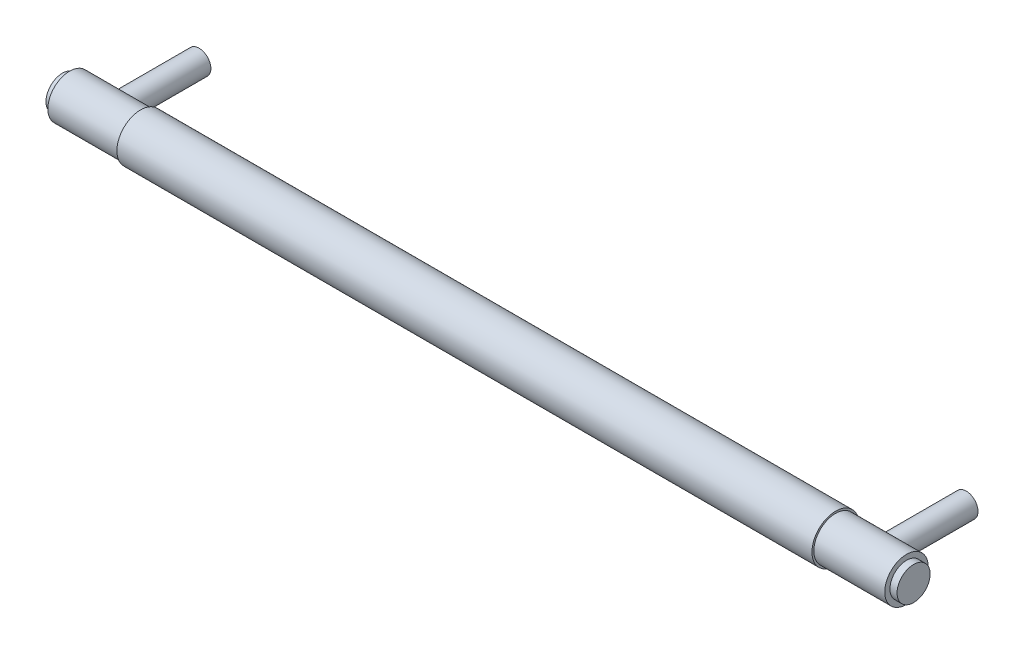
from build123d import *

# Parameters (mm, degrees)
SKETCH1_R           = 10
BOSS_EXTRUDE1_DEPTH = 147
SKETCH2_R           = 9.2
BOSS_EXTRUDE3_DEPTH = 30
SKETCH3_R           = 7
BOSS_EXTRUDE4_DEPTH = 3
SKETCH4_R           = 5
BOSS_EXTRUDE5_DEPTH = 40


with BuildPart() as part:
    # Sketch1 → Boss-Extrude1 (new body)
    with BuildSketch(Plane(origin=(0, 0, 0), x_dir=(0, 0, -1), z_dir=(1, 0, 0))):
        Circle(SKETCH1_R)
    boss_extrude1 = extrude(amount=BOSS_EXTRUDE1_DEPTH)

    # Sketch2 → Boss-Extrude3 (add)
    with BuildSketch(Plane(origin=(147, 0, 0), x_dir=(0, 0, -1), z_dir=(1, 0, 0))):
        Circle(SKETCH2_R)
    boss_extrude3 = extrude(amount=BOSS_EXTRUDE3_DEPTH)

    # Sketch3 → Boss-Extrude4 (add)
    with BuildSketch(Plane(origin=(177, 0, 0), x_dir=(0, 0, -1), z_dir=(1, 0, 0))):
        Circle(SKETCH3_R)
    boss_extrude4 = extrude(amount=BOSS_EXTRUDE4_DEPTH)

    # Mirror1: Boss-Extrude1, Boss-Extrude3, Boss-Extrude4 across plane
    add(boss_extrude1.mirror(Plane(origin=(0, 0, 0), x_dir=(0, 0, 1), z_dir=(1, 0, 0))))
    add(boss_extrude3.mirror(Plane(origin=(0, 0, 0), x_dir=(0, 0, 1), z_dir=(1, 0, 0))))
    add(boss_extrude4.mirror(Plane(origin=(0, 0, 0), x_dir=(0, 0, 1), z_dir=(1, 0, 0))))

    # Sketch4 → Boss-Extrude5 (add)
    with BuildSketch(Plane.XY):
        with Locations((-162.25, 0)):
            Circle(SKETCH4_R)
    boss_extrude5 = extrude(amount=-BOSS_EXTRUDE5_DEPTH)

    # Mirror2: Boss-Extrude5 across plane
    add(boss_extrude5.mirror(Plane(origin=(0, 0, 0), x_dir=(0, 0, 1), z_dir=(1, 0, 0))))


solid = part.part
